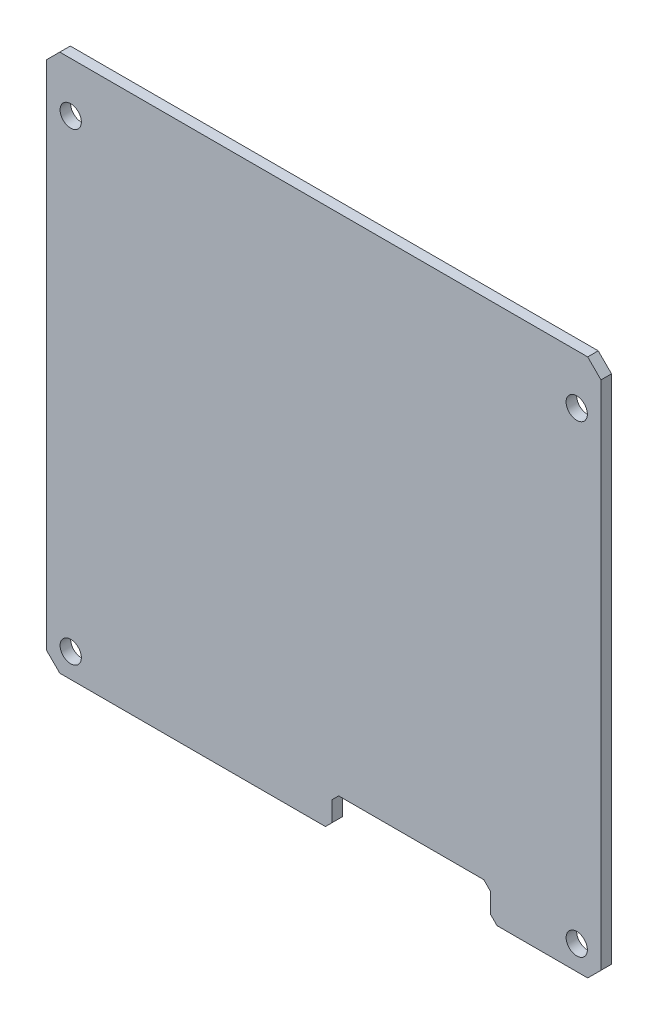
from build123d import *

# Parameters (mm, degrees)
SKETCH1_W           = 83.5
SKETCH1_H           = 81
BOSS_EXTRUDE1_DEPTH = 1.5875
CUT_EXTRUDE6_REACH  = 60.188
SKETCH8_R           = 1.6
CHAMFER1_SIZE       = 2
CUT_EXTRUDE7_REACH  = 60.188
SKETCH9_W           = 23.85
SKETCH9_H           = 5
CHAMFER2_SIZE       = 1


with BuildPart() as part:
    # Sketch1 → Boss-Extrude1 (new body)
    with BuildSketch(Plane(origin=(0, 0, -1.6), x_dir=(-1, 0, 0), z_dir=(0, 0, -1))):
        Rectangle(SKETCH1_W, SKETCH1_H)
    extrude(amount=-BOSS_EXTRUDE1_DEPTH)

    # Sketch8 → Cut-Extrude6 (cut, up to next)
    with BuildSketch(Plane(origin=(0, 0, -1.6), x_dir=(-1, 0, 0), z_dir=(0, 0, -1)), mode=Mode.PRIVATE) as cut_extrude6_sk1:
        with Locations((38.1, 33)):
            Circle(SKETCH8_R)
    cut_extrude6_tool1 = extrude(cut_extrude6_sk1.sketch, amount=-CUT_EXTRUDE6_REACH, mode=Mode.PRIVATE) & part.part
    # Sketch8 → Cut-Extrude6 (cut, up to next)
    with BuildSketch(Plane(origin=(0, 0, -1.6), x_dir=(-1, 0, 0), z_dir=(0, 0, -1)), mode=Mode.PRIVATE) as cut_extrude6_sk2:
        with Locations((-38.1, 33)):
            Circle(SKETCH8_R)
    cut_extrude6_tool2 = extrude(cut_extrude6_sk2.sketch, amount=-CUT_EXTRUDE6_REACH, mode=Mode.PRIVATE) & part.part
    # Sketch8 → Cut-Extrude6 (cut, up to next)
    with BuildSketch(Plane(origin=(0, 0, -1.6), x_dir=(-1, 0, 0), z_dir=(0, 0, -1)), mode=Mode.PRIVATE) as cut_extrude6_sk3:
        with Locations((-38.1, -36.85)):
            Circle(SKETCH8_R)
    cut_extrude6_tool3 = extrude(cut_extrude6_sk3.sketch, amount=-CUT_EXTRUDE6_REACH, mode=Mode.PRIVATE) & part.part
    # Sketch8 → Cut-Extrude6 (cut, up to next)
    with BuildSketch(Plane(origin=(0, 0, -1.6), x_dir=(-1, 0, 0), z_dir=(0, 0, -1)), mode=Mode.PRIVATE) as cut_extrude6_sk4:
        with Locations((38.1, -36.85)):
            Circle(SKETCH8_R)
    cut_extrude6_tool4 = extrude(cut_extrude6_sk4.sketch, amount=-CUT_EXTRUDE6_REACH, mode=Mode.PRIVATE) & part.part
    add(cut_extrude6_tool1.solids().sort_by_distance((-38.1, 33, -1.6))[0], mode=Mode.SUBTRACT)
    add(cut_extrude6_tool2.solids().sort_by_distance((38.1, 33, -1.6))[0], mode=Mode.SUBTRACT)
    add(cut_extrude6_tool3.solids().sort_by_distance((38.1, -36.85, -1.6))[0], mode=Mode.SUBTRACT)
    add(cut_extrude6_tool4.solids().sort_by_distance((-38.1, -36.85, -1.6))[0], mode=Mode.SUBTRACT)

    # Chamfer1
    chamfer1_edges = [part.edges().sort_by_distance(p)[0] for p in [
        (-41.75, -40.5, -0.80625),
        (41.75, -40.5, -0.80625),
        (41.75, 40.5, -0.80625),
        (-41.75, 40.5, -0.80625),
    ]]
    chamfer(chamfer1_edges, length=CHAMFER1_SIZE)

    # Sketch9 → Cut-Extrude7 (cut, up to next)
    with BuildSketch(Plane(origin=(0, 0, -1.6), x_dir=(-1, 0, 0), z_dir=(0, 0, -1)), mode=Mode.PRIVATE) as cut_extrude7_sk1:
        with Locations((-13.175, -38)):
            Rectangle(SKETCH9_W, SKETCH9_H)
    cut_extrude7_tool1 = extrude(cut_extrude7_sk1.sketch, amount=-CUT_EXTRUDE7_REACH, mode=Mode.PRIVATE) & part.part
    add(cut_extrude7_tool1.solids().sort_by_distance((13.175, -38, -1.6))[0], mode=Mode.SUBTRACT)

    # Chamfer2
    chamfer2_edges = [part.edges().sort_by_distance(p)[0] for p in [
        (1.25, -35.5, -0.80625),
        (1.25, -40.5, -0.80625),
        (25.1, -40.5, -0.80625),
        (25.1, -35.5, -0.80625),
    ]]
    chamfer(chamfer2_edges, length=CHAMFER2_SIZE)


solid = part.part
